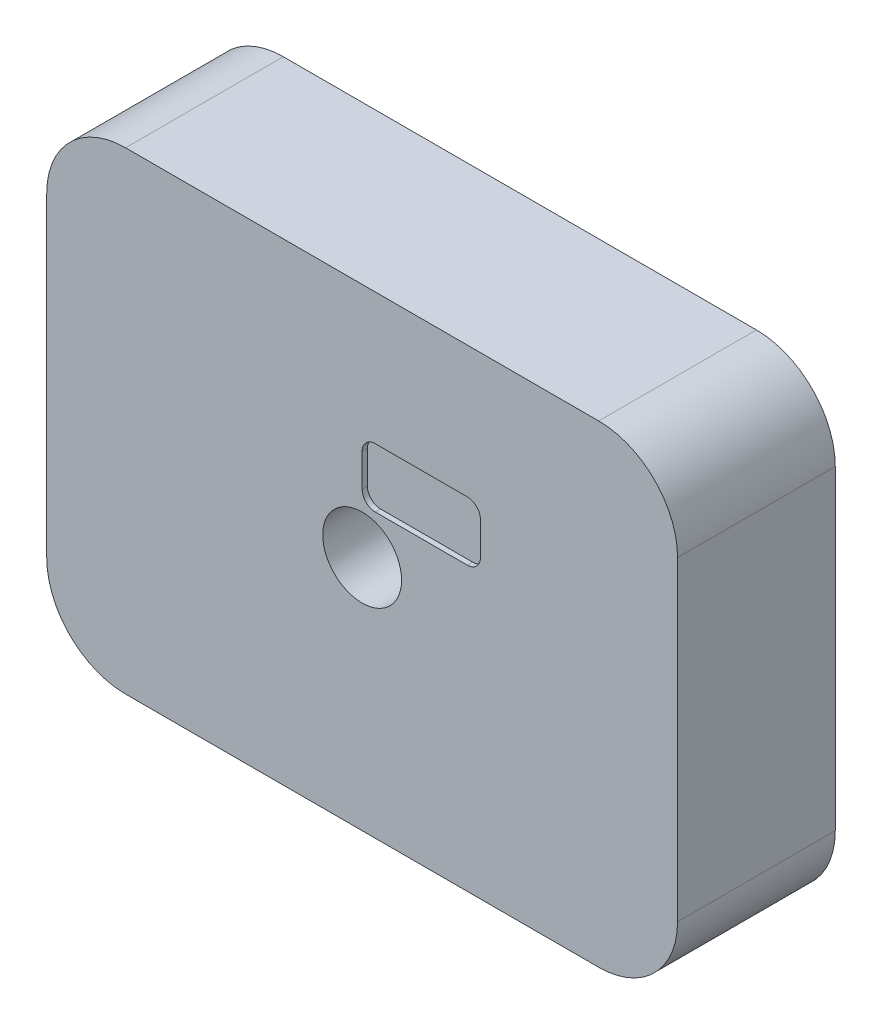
ISO-10303-21;
HEADER;
FILE_DESCRIPTION(('STEP AP214'),'2;1');
FILE_NAME('part.step','',(''),(''),'','','');
FILE_SCHEMA(('AUTOMOTIVE_DESIGN { 1 0 10303 214 1 1 1 1 }'));
ENDSEC;
DATA;
#1=APPLICATION_CONTEXT('core data for automotive mechanical design processes');
#2=APPLICATION_PROTOCOL_DEFINITION('international standard','automotive_design',2000,#1);
#3=PRODUCT_CONTEXT('',#1,'mechanical');
#4=PRODUCT('Part','Part','',(#3));
#5=PRODUCT_RELATED_PRODUCT_CATEGORY('part','',(#4));
#6=PRODUCT_DEFINITION_FORMATION('','',#4);
#7=PRODUCT_DEFINITION_CONTEXT('part definition',#1,'design');
#8=PRODUCT_DEFINITION('design','',#6,#7);
#9=PRODUCT_DEFINITION_SHAPE('','',#8);
#10=(LENGTH_UNIT() NAMED_UNIT(*) SI_UNIT(.MILLI.,.METRE.));
#11=(NAMED_UNIT(*) PLANE_ANGLE_UNIT() SI_UNIT($,.RADIAN.));
#12=(NAMED_UNIT(*) SI_UNIT($,.STERADIAN.) SOLID_ANGLE_UNIT());
#13=UNCERTAINTY_MEASURE_WITH_UNIT(LENGTH_MEASURE(1.E-05),#10,'distance_accuracy_value','');
#14=(GEOMETRIC_REPRESENTATION_CONTEXT(3) GLOBAL_UNCERTAINTY_ASSIGNED_CONTEXT((#13)) GLOBAL_UNIT_ASSIGNED_CONTEXT((#10,
#11,#12)) REPRESENTATION_CONTEXT('',''));
#15=CARTESIAN_POINT('',(0.,0.,0.));
#16=DIRECTION('',(0.,0.,1.));
#17=DIRECTION('',(1.,0.,0.));
#18=AXIS2_PLACEMENT_3D('',#15,#16,#17);
#19=CARTESIAN_POINT('',(24.,18.,12.));
#20=DIRECTION('',(-1.,0.,0.));
#21=DIRECTION('',(0.,0.,1.));
#22=AXIS2_PLACEMENT_3D('',#19,#20,#21);
#23=PLANE('',#22);
#24=DIRECTION('',(0.,1.,0.));
#25=VECTOR('',#24,1.);
#26=CARTESIAN_POINT('',(24.,18.,12.));
#27=LINE('',#26,#25);
#28=CARTESIAN_POINT('',(24.,-12.,12.));
#29=VERTEX_POINT('',#28);
#30=CARTESIAN_POINT('',(24.,12.,12.));
#31=VERTEX_POINT('',#30);
#32=EDGE_CURVE('E271',#29,#31,#27,.T.);
#33=ORIENTED_EDGE('',*,*,#32,.F.);
#34=DIRECTION('',(0.,0.,-1.));
#35=VECTOR('',#34,1.);
#36=CARTESIAN_POINT('',(24.,-12.,12.));
#37=LINE('',#36,#35);
#38=CARTESIAN_POINT('',(24.,-12.,0.));
#39=VERTEX_POINT('',#38);
#40=EDGE_CURVE('E300',#29,#39,#37,.T.);
#41=ORIENTED_EDGE('',*,*,#40,.T.);
#42=DIRECTION('',(0.,1.,0.));
#43=VECTOR('',#42,1.);
#44=CARTESIAN_POINT('',(24.,18.,0.));
#45=LINE('',#44,#43);
#46=CARTESIAN_POINT('',(24.,12.,0.));
#47=VERTEX_POINT('',#46);
#48=EDGE_CURVE('E270',#39,#47,#45,.T.);
#49=ORIENTED_EDGE('',*,*,#48,.T.);
#50=DIRECTION('',(0.,0.,-1.));
#51=VECTOR('',#50,1.);
#52=CARTESIAN_POINT('',(24.,12.,12.));
#53=LINE('',#52,#51);
#54=EDGE_CURVE('E298',#47,#31,#53,.F.);
#55=ORIENTED_EDGE('',*,*,#54,.T.);
#56=EDGE_LOOP('',(#33,#41,#49,#55));
#57=FACE_BOUND('',#56,.T.);
#58=ADVANCED_FACE('F48',(#57),#23,.F.);
#59=CARTESIAN_POINT('',(-24.,18.,12.));
#60=DIRECTION('',(0.,-1.,0.));
#61=DIRECTION('',(0.,0.,-1.));
#62=AXIS2_PLACEMENT_3D('',#59,#60,#61);
#63=PLANE('',#62);
#64=DIRECTION('',(-1.,0.,0.));
#65=VECTOR('',#64,1.);
#66=CARTESIAN_POINT('',(-24.,18.,12.));
#67=LINE('',#66,#65);
#68=CARTESIAN_POINT('',(18.,18.,12.));
#69=VERTEX_POINT('',#68);
#70=CARTESIAN_POINT('',(-18.,18.,12.));
#71=VERTEX_POINT('',#70);
#72=EDGE_CURVE('E274',#69,#71,#67,.T.);
#73=ORIENTED_EDGE('',*,*,#72,.F.);
#74=DIRECTION('',(0.,0.,-1.));
#75=VECTOR('',#74,1.);
#76=CARTESIAN_POINT('',(18.,18.,12.));
#77=LINE('',#76,#75);
#78=CARTESIAN_POINT('',(18.,18.,0.));
#79=VERTEX_POINT('',#78);
#80=EDGE_CURVE('E326',#69,#79,#77,.T.);
#81=ORIENTED_EDGE('',*,*,#80,.T.);
#82=DIRECTION('',(-1.,0.,0.));
#83=VECTOR('',#82,1.);
#84=CARTESIAN_POINT('',(-24.,18.,0.));
#85=LINE('',#84,#83);
#86=CARTESIAN_POINT('',(-18.,18.,0.));
#87=VERTEX_POINT('',#86);
#88=EDGE_CURVE('E286',#79,#87,#85,.T.);
#89=ORIENTED_EDGE('',*,*,#88,.T.);
#90=DIRECTION('',(0.,0.,-1.));
#91=VECTOR('',#90,1.);
#92=CARTESIAN_POINT('',(-18.,18.,12.));
#93=LINE('',#92,#91);
#94=EDGE_CURVE('E324',#87,#71,#93,.F.);
#95=ORIENTED_EDGE('',*,*,#94,.T.);
#96=EDGE_LOOP('',(#73,#81,#89,#95));
#97=FACE_BOUND('',#96,.T.);
#98=ADVANCED_FACE('F362',(#97),#63,.F.);
#99=CARTESIAN_POINT('',(-24.,18.,12.));
#100=DIRECTION('',(1.,0.,0.));
#101=DIRECTION('',(0.,0.,-1.));
#102=AXIS2_PLACEMENT_3D('',#99,#100,#101);
#103=PLANE('',#102);
#104=DIRECTION('',(0.,-1.,0.));
#105=VECTOR('',#104,1.);
#106=CARTESIAN_POINT('',(-24.,18.,0.));
#107=LINE('',#106,#105);
#108=CARTESIAN_POINT('',(-24.,12.,0.));
#109=VERTEX_POINT('',#108);
#110=CARTESIAN_POINT('',(-24.,-12.,0.));
#111=VERTEX_POINT('',#110);
#112=EDGE_CURVE('E289',#109,#111,#107,.T.);
#113=ORIENTED_EDGE('',*,*,#112,.T.);
#114=DIRECTION('',(0.,0.,-1.));
#115=VECTOR('',#114,1.);
#116=CARTESIAN_POINT('',(-24.,-12.,12.));
#117=LINE('',#116,#115);
#118=CARTESIAN_POINT('',(-24.,-12.,12.));
#119=VERTEX_POINT('',#118);
#120=EDGE_CURVE('E13',#111,#119,#117,.F.);
#121=ORIENTED_EDGE('',*,*,#120,.T.);
#122=DIRECTION('',(0.,-1.,0.));
#123=VECTOR('',#122,1.);
#124=CARTESIAN_POINT('',(-24.,18.,12.));
#125=LINE('',#124,#123);
#126=CARTESIAN_POINT('',(-24.,12.,12.));
#127=VERTEX_POINT('',#126);
#128=EDGE_CURVE('E278',#127,#119,#125,.T.);
#129=ORIENTED_EDGE('',*,*,#128,.F.);
#130=DIRECTION('',(0.,0.,-1.));
#131=VECTOR('',#130,1.);
#132=CARTESIAN_POINT('',(-24.,12.,12.));
#133=LINE('',#132,#131);
#134=EDGE_CURVE('E56',#127,#109,#133,.T.);
#135=ORIENTED_EDGE('',*,*,#134,.T.);
#136=EDGE_LOOP('',(#113,#121,#129,#135));
#137=FACE_BOUND('',#136,.T.);
#138=ADVANCED_FACE('F331',(#137),#103,.F.);
#139=CARTESIAN_POINT('',(-24.,-18.,12.));
#140=DIRECTION('',(0.,1.,0.));
#141=DIRECTION('',(-1.,0.,0.));
#142=AXIS2_PLACEMENT_3D('',#139,#140,#141);
#143=PLANE('',#142);
#144=DIRECTION('',(1.,0.,0.));
#145=VECTOR('',#144,1.);
#146=CARTESIAN_POINT('',(-24.,-18.,0.));
#147=LINE('',#146,#145);
#148=CARTESIAN_POINT('',(-18.,-18.,0.));
#149=VERTEX_POINT('',#148);
#150=CARTESIAN_POINT('',(18.,-18.,0.));
#151=VERTEX_POINT('',#150);
#152=EDGE_CURVE('E275',#149,#151,#147,.T.);
#153=ORIENTED_EDGE('',*,*,#152,.T.);
#154=DIRECTION('',(0.,0.,-1.));
#155=VECTOR('',#154,1.);
#156=CARTESIAN_POINT('',(18.,-18.,12.));
#157=LINE('',#156,#155);
#158=CARTESIAN_POINT('',(18.,-18.,12.));
#159=VERTEX_POINT('',#158);
#160=EDGE_CURVE('E314',#151,#159,#157,.F.);
#161=ORIENTED_EDGE('',*,*,#160,.T.);
#162=DIRECTION('',(1.,0.,0.));
#163=VECTOR('',#162,1.);
#164=CARTESIAN_POINT('',(-24.,-18.,12.));
#165=LINE('',#164,#163);
#166=CARTESIAN_POINT('',(-18.,-18.,12.));
#167=VERTEX_POINT('',#166);
#168=EDGE_CURVE('E280',#167,#159,#165,.T.);
#169=ORIENTED_EDGE('',*,*,#168,.F.);
#170=DIRECTION('',(0.,0.,-1.));
#171=VECTOR('',#170,1.);
#172=CARTESIAN_POINT('',(-18.,-18.,12.));
#173=LINE('',#172,#171);
#174=EDGE_CURVE('E311',#167,#149,#173,.T.);
#175=ORIENTED_EDGE('',*,*,#174,.T.);
#176=EDGE_LOOP('',(#153,#161,#169,#175));
#177=FACE_BOUND('',#176,.T.);
#178=ADVANCED_FACE('F345',(#177),#143,.F.);
#179=CARTESIAN_POINT('',(24.,18.,12.));
#180=DIRECTION('',(0.,0.,1.));
#181=DIRECTION('',(1.,0.,0.));
#182=AXIS2_PLACEMENT_3D('',#179,#180,#181);
#183=PLANE('',#182);
#184=CARTESIAN_POINT('',(8.,4.5,12.));
#185=DIRECTION('',(0.,0.,1.));
#186=DIRECTION('',(1.,0.,0.));
#187=AXIS2_PLACEMENT_3D('',#184,#185,#186);
#188=CIRCLE('',#187,0.999999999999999);
#189=CARTESIAN_POINT('',(7.99999999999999,3.5,12.));
#190=VERTEX_POINT('',#189);
#191=CARTESIAN_POINT('',(9.,4.50000000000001,12.));
#192=VERTEX_POINT('',#191);
#193=EDGE_CURVE('E63',#190,#192,#188,.T.);
#194=ORIENTED_EDGE('',*,*,#193,.F.);
#195=DIRECTION('',(1.,0.,0.));
#196=VECTOR('',#195,1.);
#197=CARTESIAN_POINT('',(1.00000000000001,3.5,12.));
#198=LINE('',#197,#196);
#199=CARTESIAN_POINT('',(1.00000000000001,3.5,12.));
#200=VERTEX_POINT('',#199);
#201=EDGE_CURVE('E194',#200,#190,#198,.T.);
#202=ORIENTED_EDGE('',*,*,#201,.F.);
#203=CARTESIAN_POINT('',(1.,4.5,12.));
#204=DIRECTION('',(0.,0.,1.));
#205=DIRECTION('',(1.,0.,0.));
#206=AXIS2_PLACEMENT_3D('',#203,#204,#205);
#207=CIRCLE('',#206,1.);
#208=CARTESIAN_POINT('',(0.,4.50000000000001,12.));
#209=VERTEX_POINT('',#208);
#210=EDGE_CURVE('E197',#209,#200,#207,.T.);
#211=ORIENTED_EDGE('',*,*,#210,.F.);
#212=DIRECTION('',(0.,-1.,0.));
#213=VECTOR('',#212,1.);
#214=CARTESIAN_POINT('',(0.,6.99999999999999,12.));
#215=LINE('',#214,#213);
#216=CARTESIAN_POINT('',(0.,6.99999999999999,12.));
#217=VERTEX_POINT('',#216);
#218=EDGE_CURVE('E225',#217,#209,#215,.T.);
#219=ORIENTED_EDGE('',*,*,#218,.F.);
#220=CARTESIAN_POINT('',(0.999999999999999,7.,12.));
#221=DIRECTION('',(0.,0.,1.));
#222=DIRECTION('',(1.,0.,0.));
#223=AXIS2_PLACEMENT_3D('',#220,#221,#222);
#224=CIRCLE('',#223,1.);
#225=CARTESIAN_POINT('',(1.00000000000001,8.,12.));
#226=VERTEX_POINT('',#225);
#227=EDGE_CURVE('E222',#226,#217,#224,.T.);
#228=ORIENTED_EDGE('',*,*,#227,.F.);
#229=DIRECTION('',(-1.,0.,0.));
#230=VECTOR('',#229,1.);
#231=CARTESIAN_POINT('',(1.00000000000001,8.,12.));
#232=LINE('',#231,#230);
#233=CARTESIAN_POINT('',(7.99999999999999,8.,12.));
#234=VERTEX_POINT('',#233);
#235=EDGE_CURVE('E219',#234,#226,#232,.T.);
#236=ORIENTED_EDGE('',*,*,#235,.F.);
#237=CARTESIAN_POINT('',(8.,7.,12.));
#238=DIRECTION('',(0.,0.,1.));
#239=DIRECTION('',(-1.,0.,0.));
#240=AXIS2_PLACEMENT_3D('',#237,#238,#239);
#241=CIRCLE('',#240,1.);
#242=CARTESIAN_POINT('',(9.,6.99999999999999,12.));
#243=VERTEX_POINT('',#242);
#244=EDGE_CURVE('E216',#243,#234,#241,.T.);
#245=ORIENTED_EDGE('',*,*,#244,.F.);
#246=DIRECTION('',(0.,1.,0.));
#247=VECTOR('',#246,1.);
#248=CARTESIAN_POINT('',(9.,6.99999999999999,12.));
#249=LINE('',#248,#247);
#250=EDGE_CURVE('E214',#192,#243,#249,.T.);
#251=ORIENTED_EDGE('',*,*,#250,.F.);
#252=EDGE_LOOP('',(#194,#202,#211,#219,#228,#236,#245,#251));
#253=FACE_BOUND('',#252,.T.);
#254=CARTESIAN_POINT('',(0.,0.,12.));
#255=DIRECTION('',(0.,0.,1.));
#256=DIRECTION('',(1.,0.,0.));
#257=AXIS2_PLACEMENT_3D('',#254,#255,#256);
#258=CIRCLE('',#257,3.);
#259=CARTESIAN_POINT('',(3.,0.,12.));
#260=VERTEX_POINT('',#259);
#261=EDGE_CURVE('E267',#260,#260,#258,.T.);
#262=ORIENTED_EDGE('',*,*,#261,.F.);
#263=EDGE_LOOP('',(#262));
#264=FACE_BOUND('',#263,.T.);
#265=ORIENTED_EDGE('',*,*,#168,.T.);
#266=CARTESIAN_POINT('',(18.,-12.,12.));
#267=DIRECTION('',(0.,0.,1.));
#268=DIRECTION('',(1.,0.,0.));
#269=AXIS2_PLACEMENT_3D('',#266,#267,#268);
#270=CIRCLE('',#269,6.);
#271=EDGE_CURVE('E322',#159,#29,#270,.T.);
#272=ORIENTED_EDGE('',*,*,#271,.T.);
#273=ORIENTED_EDGE('',*,*,#32,.T.);
#274=CARTESIAN_POINT('',(18.,12.,12.));
#275=DIRECTION('',(0.,0.,1.));
#276=DIRECTION('',(1.,0.,0.));
#277=AXIS2_PLACEMENT_3D('',#274,#275,#276);
#278=CIRCLE('',#277,6.);
#279=EDGE_CURVE('E320',#31,#69,#278,.T.);
#280=ORIENTED_EDGE('',*,*,#279,.T.);
#281=ORIENTED_EDGE('',*,*,#72,.T.);
#282=CARTESIAN_POINT('',(-18.,12.,12.));
#283=DIRECTION('',(0.,0.,1.));
#284=DIRECTION('',(1.,0.,0.));
#285=AXIS2_PLACEMENT_3D('',#282,#283,#284);
#286=CIRCLE('',#285,6.);
#287=EDGE_CURVE('E316',#71,#127,#286,.T.);
#288=ORIENTED_EDGE('',*,*,#287,.T.);
#289=ORIENTED_EDGE('',*,*,#128,.T.);
#290=CARTESIAN_POINT('',(-18.,-12.,12.));
#291=DIRECTION('',(0.,0.,1.));
#292=DIRECTION('',(1.,0.,0.));
#293=AXIS2_PLACEMENT_3D('',#290,#291,#292);
#294=CIRCLE('',#293,6.);
#295=EDGE_CURVE('E318',#119,#167,#294,.T.);
#296=ORIENTED_EDGE('',*,*,#295,.T.);
#297=EDGE_LOOP('',(#265,#272,#273,#280,#281,#288,#289,#296));
#298=FACE_BOUND('',#297,.T.);
#299=ADVANCED_FACE('F349',(#253,#264,#298),#183,.T.);
#300=CARTESIAN_POINT('',(24.,18.,0.));
#301=DIRECTION('',(0.,0.,1.));
#302=DIRECTION('',(1.,0.,0.));
#303=AXIS2_PLACEMENT_3D('',#300,#301,#302);
#304=PLANE('',#303);
#305=CARTESIAN_POINT('',(-18.,12.,0.));
#306=DIRECTION('',(0.,0.,-1.));
#307=DIRECTION('',(-1.,0.,0.));
#308=AXIS2_PLACEMENT_3D('',#305,#306,#307);
#309=CIRCLE('',#308,1.64999999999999);
#310=CARTESIAN_POINT('',(-19.65,12.,0.));
#311=VERTEX_POINT('',#310);
#312=EDGE_CURVE('E232',#311,#311,#309,.T.);
#313=ORIENTED_EDGE('',*,*,#312,.F.);
#314=EDGE_LOOP('',(#313));
#315=FACE_BOUND('',#314,.T.);
#316=CARTESIAN_POINT('',(18.,12.,0.));
#317=DIRECTION('',(0.,0.,-1.));
#318=DIRECTION('',(-1.,0.,0.));
#319=AXIS2_PLACEMENT_3D('',#316,#317,#318);
#320=CIRCLE('',#319,1.64999999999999);
#321=CARTESIAN_POINT('',(16.35,12.,0.));
#322=VERTEX_POINT('',#321);
#323=EDGE_CURVE('E249',#322,#322,#320,.T.);
#324=ORIENTED_EDGE('',*,*,#323,.F.);
#325=EDGE_LOOP('',(#324));
#326=FACE_BOUND('',#325,.T.);
#327=CARTESIAN_POINT('',(18.,-12.,0.));
#328=DIRECTION('',(0.,0.,-1.));
#329=DIRECTION('',(-1.,0.,0.));
#330=AXIS2_PLACEMENT_3D('',#327,#328,#329);
#331=CIRCLE('',#330,1.64999999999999);
#332=CARTESIAN_POINT('',(16.35,-12.,0.));
#333=VERTEX_POINT('',#332);
#334=EDGE_CURVE('E255',#333,#333,#331,.T.);
#335=ORIENTED_EDGE('',*,*,#334,.F.);
#336=EDGE_LOOP('',(#335));
#337=FACE_BOUND('',#336,.T.);
#338=CARTESIAN_POINT('',(-18.,-12.,0.));
#339=DIRECTION('',(0.,0.,-1.));
#340=DIRECTION('',(-1.,0.,0.));
#341=AXIS2_PLACEMENT_3D('',#338,#339,#340);
#342=CIRCLE('',#341,1.64999999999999);
#343=CARTESIAN_POINT('',(-19.65,-12.,0.));
#344=VERTEX_POINT('',#343);
#345=EDGE_CURVE('E261',#344,#344,#342,.T.);
#346=ORIENTED_EDGE('',*,*,#345,.F.);
#347=EDGE_LOOP('',(#346));
#348=FACE_BOUND('',#347,.T.);
#349=CARTESIAN_POINT('',(0.,0.,0.));
#350=DIRECTION('',(0.,0.,1.));
#351=DIRECTION('',(1.,0.,0.));
#352=AXIS2_PLACEMENT_3D('',#349,#350,#351);
#353=CIRCLE('',#352,3.5);
#354=CARTESIAN_POINT('',(3.5,0.,0.));
#355=VERTEX_POINT('',#354);
#356=EDGE_CURVE('E283',#355,#355,#353,.T.);
#357=ORIENTED_EDGE('',*,*,#356,.T.);
#358=EDGE_LOOP('',(#357));
#359=FACE_BOUND('',#358,.T.);
#360=ORIENTED_EDGE('',*,*,#48,.F.);
#361=CARTESIAN_POINT('',(18.,-12.,0.));
#362=DIRECTION('',(0.,0.,1.));
#363=DIRECTION('',(1.,0.,0.));
#364=AXIS2_PLACEMENT_3D('',#361,#362,#363);
#365=CIRCLE('',#364,6.);
#366=EDGE_CURVE('E309',#39,#151,#365,.F.);
#367=ORIENTED_EDGE('',*,*,#366,.T.);
#368=ORIENTED_EDGE('',*,*,#152,.F.);
#369=CARTESIAN_POINT('',(-18.,-12.,0.));
#370=DIRECTION('',(0.,0.,1.));
#371=DIRECTION('',(1.,0.,0.));
#372=AXIS2_PLACEMENT_3D('',#369,#370,#371);
#373=CIRCLE('',#372,6.);
#374=EDGE_CURVE('E305',#149,#111,#373,.F.);
#375=ORIENTED_EDGE('',*,*,#374,.T.);
#376=ORIENTED_EDGE('',*,*,#112,.F.);
#377=CARTESIAN_POINT('',(-18.,12.,0.));
#378=DIRECTION('',(0.,0.,1.));
#379=DIRECTION('',(1.,0.,0.));
#380=AXIS2_PLACEMENT_3D('',#377,#378,#379);
#381=CIRCLE('',#380,6.);
#382=EDGE_CURVE('E303',#109,#87,#381,.F.);
#383=ORIENTED_EDGE('',*,*,#382,.T.);
#384=ORIENTED_EDGE('',*,*,#88,.F.);
#385=CARTESIAN_POINT('',(18.,12.,0.));
#386=DIRECTION('',(0.,0.,1.));
#387=DIRECTION('',(1.,0.,0.));
#388=AXIS2_PLACEMENT_3D('',#385,#386,#387);
#389=CIRCLE('',#388,6.);
#390=EDGE_CURVE('E307',#79,#47,#389,.F.);
#391=ORIENTED_EDGE('',*,*,#390,.T.);
#392=EDGE_LOOP('',(#360,#367,#368,#375,#376,#383,#384,#391));
#393=FACE_BOUND('',#392,.T.);
#394=ADVANCED_FACE('F336',(#315,#326,#337,#348,#359,#393),#304,.F.);
#395=CARTESIAN_POINT('',(0.,0.,0.));
#396=DIRECTION('',(0.,0.,1.));
#397=DIRECTION('',(1.,0.,0.));
#398=AXIS2_PLACEMENT_3D('',#395,#396,#397);
#399=CYLINDRICAL_SURFACE('',#398,3.);
#400=CARTESIAN_POINT('',(0.,0.,0.500000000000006));
#401=DIRECTION('',(0.,0.,1.));
#402=DIRECTION('',(1.,0.,0.));
#403=AXIS2_PLACEMENT_3D('',#400,#401,#402);
#404=CIRCLE('',#403,3.);
#405=CARTESIAN_POINT('',(3.,0.,0.500000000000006));
#406=VERTEX_POINT('',#405);
#407=EDGE_CURVE('E295',#406,#406,#404,.F.);
#408=ORIENTED_EDGE('',*,*,#407,.T.);
#409=EDGE_LOOP('',(#408));
#410=FACE_BOUND('',#409,.T.);
#411=ORIENTED_EDGE('',*,*,#261,.T.);
#412=EDGE_LOOP('',(#411));
#413=FACE_BOUND('',#412,.T.);
#414=ADVANCED_FACE('F383',(#410,#413),#399,.F.);
#415=CARTESIAN_POINT('',(0.,0.,0.));
#416=DIRECTION('',(0.,0.,-1.));
#417=DIRECTION('',(-1.,0.,0.));
#418=AXIS2_PLACEMENT_3D('',#415,#416,#417);
#419=CONICAL_SURFACE('',#418,3.5,0.785398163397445);
#420=ORIENTED_EDGE('',*,*,#407,.F.);
#421=EDGE_LOOP('',(#420));
#422=FACE_BOUND('',#421,.T.);
#423=ORIENTED_EDGE('',*,*,#356,.F.);
#424=EDGE_LOOP('',(#423));
#425=FACE_BOUND('',#424,.T.);
#426=ADVANCED_FACE('F379',(#422,#425),#419,.F.);
#427=CARTESIAN_POINT('',(-18.,-12.,10.1));
#428=DIRECTION('',(0.,0.,-1.));
#429=DIRECTION('',(-1.,0.,0.));
#430=AXIS2_PLACEMENT_3D('',#427,#428,#429);
#431=CONICAL_SURFACE('',#430,1.64999999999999,1.02974425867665);
#432=CARTESIAN_POINT('',(-18.,-12.,11.0914200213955));
#433=VERTEX_POINT('',#432);
#434=VERTEX_LOOP('',#433);
#435=FACE_BOUND('',#434,.T.);
#436=CARTESIAN_POINT('',(-18.,-12.,10.1));
#437=DIRECTION('',(0.,0.,-1.));
#438=DIRECTION('',(-1.,0.,0.));
#439=AXIS2_PLACEMENT_3D('',#436,#437,#438);
#440=CIRCLE('',#439,1.64999999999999);
#441=CARTESIAN_POINT('',(-19.65,-12.,10.1));
#442=VERTEX_POINT('',#441);
#443=EDGE_CURVE('E264',#442,#442,#440,.T.);
#444=ORIENTED_EDGE('',*,*,#443,.T.);
#445=EDGE_LOOP('',(#444));
#446=FACE_BOUND('',#445,.T.);
#447=ADVANCED_FACE('F382',(#435,#446),#431,.F.);
#448=CARTESIAN_POINT('',(-18.,-12.,0.));
#449=DIRECTION('',(0.,0.,-1.));
#450=DIRECTION('',(-1.,0.,0.));
#451=AXIS2_PLACEMENT_3D('',#448,#449,#450);
#452=CYLINDRICAL_SURFACE('',#451,1.64999999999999);
#453=ORIENTED_EDGE('',*,*,#443,.F.);
#454=EDGE_LOOP('',(#453));
#455=FACE_BOUND('',#454,.T.);
#456=ORIENTED_EDGE('',*,*,#345,.T.);
#457=EDGE_LOOP('',(#456));
#458=FACE_BOUND('',#457,.T.);
#459=ADVANCED_FACE('F522',(#455,#458),#452,.F.);
#460=CARTESIAN_POINT('',(18.,-12.,10.1));
#461=DIRECTION('',(0.,0.,-1.));
#462=DIRECTION('',(-1.,0.,0.));
#463=AXIS2_PLACEMENT_3D('',#460,#461,#462);
#464=CONICAL_SURFACE('',#463,1.64999999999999,1.02974425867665);
#465=CARTESIAN_POINT('',(18.,-12.,11.0914200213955));
#466=VERTEX_POINT('',#465);
#467=VERTEX_LOOP('',#466);
#468=FACE_BOUND('',#467,.T.);
#469=CARTESIAN_POINT('',(18.,-12.,10.1));
#470=DIRECTION('',(0.,0.,-1.));
#471=DIRECTION('',(-1.,0.,0.));
#472=AXIS2_PLACEMENT_3D('',#469,#470,#471);
#473=CIRCLE('',#472,1.64999999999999);
#474=CARTESIAN_POINT('',(16.35,-12.,10.1));
#475=VERTEX_POINT('',#474);
#476=EDGE_CURVE('E258',#475,#475,#473,.T.);
#477=ORIENTED_EDGE('',*,*,#476,.T.);
#478=EDGE_LOOP('',(#477));
#479=FACE_BOUND('',#478,.T.);
#480=ADVANCED_FACE('F518',(#468,#479),#464,.F.);
#481=CARTESIAN_POINT('',(18.,-12.,0.));
#482=DIRECTION('',(0.,0.,-1.));
#483=DIRECTION('',(-1.,0.,0.));
#484=AXIS2_PLACEMENT_3D('',#481,#482,#483);
#485=CYLINDRICAL_SURFACE('',#484,1.64999999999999);
#486=ORIENTED_EDGE('',*,*,#476,.F.);
#487=EDGE_LOOP('',(#486));
#488=FACE_BOUND('',#487,.T.);
#489=ORIENTED_EDGE('',*,*,#334,.T.);
#490=EDGE_LOOP('',(#489));
#491=FACE_BOUND('',#490,.T.);
#492=ADVANCED_FACE('F514',(#488,#491),#485,.F.);
#493=CARTESIAN_POINT('',(18.,12.,10.1));
#494=DIRECTION('',(0.,0.,-1.));
#495=DIRECTION('',(-1.,0.,0.));
#496=AXIS2_PLACEMENT_3D('',#493,#494,#495);
#497=CONICAL_SURFACE('',#496,1.64999999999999,1.02974425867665);
#498=CARTESIAN_POINT('',(18.,12.,11.0914200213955));
#499=VERTEX_POINT('',#498);
#500=VERTEX_LOOP('',#499);
#501=FACE_BOUND('',#500,.T.);
#502=CARTESIAN_POINT('',(18.,12.,10.1));
#503=DIRECTION('',(0.,0.,-1.));
#504=DIRECTION('',(-1.,0.,0.));
#505=AXIS2_PLACEMENT_3D('',#502,#503,#504);
#506=CIRCLE('',#505,1.64999999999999);
#507=CARTESIAN_POINT('',(16.35,12.,10.1));
#508=VERTEX_POINT('',#507);
#509=EDGE_CURVE('E252',#508,#508,#506,.T.);
#510=ORIENTED_EDGE('',*,*,#509,.T.);
#511=EDGE_LOOP('',(#510));
#512=FACE_BOUND('',#511,.T.);
#513=ADVANCED_FACE('F510',(#501,#512),#497,.F.);
#514=CARTESIAN_POINT('',(18.,12.,0.));
#515=DIRECTION('',(0.,0.,-1.));
#516=DIRECTION('',(-1.,0.,0.));
#517=AXIS2_PLACEMENT_3D('',#514,#515,#516);
#518=CYLINDRICAL_SURFACE('',#517,1.64999999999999);
#519=ORIENTED_EDGE('',*,*,#509,.F.);
#520=EDGE_LOOP('',(#519));
#521=FACE_BOUND('',#520,.T.);
#522=ORIENTED_EDGE('',*,*,#323,.T.);
#523=EDGE_LOOP('',(#522));
#524=FACE_BOUND('',#523,.T.);
#525=ADVANCED_FACE('F506',(#521,#524),#518,.F.);
#526=CARTESIAN_POINT('',(-18.,12.,10.1));
#527=DIRECTION('',(0.,0.,-1.));
#528=DIRECTION('',(-1.,0.,0.));
#529=AXIS2_PLACEMENT_3D('',#526,#527,#528);
#530=CONICAL_SURFACE('',#529,1.64999999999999,1.02974425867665);
#531=CARTESIAN_POINT('',(-18.,12.,11.0914200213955));
#532=VERTEX_POINT('',#531);
#533=VERTEX_LOOP('',#532);
#534=FACE_BOUND('',#533,.T.);
#535=CARTESIAN_POINT('',(-18.,12.,10.1));
#536=DIRECTION('',(0.,0.,-1.));
#537=DIRECTION('',(-1.,0.,0.));
#538=AXIS2_PLACEMENT_3D('',#535,#536,#537);
#539=CIRCLE('',#538,1.64999999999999);
#540=CARTESIAN_POINT('',(-19.65,12.,10.1));
#541=VERTEX_POINT('',#540);
#542=EDGE_CURVE('E246',#541,#541,#539,.T.);
#543=ORIENTED_EDGE('',*,*,#542,.T.);
#544=EDGE_LOOP('',(#543));
#545=FACE_BOUND('',#544,.T.);
#546=ADVANCED_FACE('F502',(#534,#545),#530,.F.);
#547=CARTESIAN_POINT('',(-18.,12.,0.));
#548=DIRECTION('',(0.,0.,-1.));
#549=DIRECTION('',(-1.,0.,0.));
#550=AXIS2_PLACEMENT_3D('',#547,#548,#549);
#551=CYLINDRICAL_SURFACE('',#550,1.64999999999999);
#552=ORIENTED_EDGE('',*,*,#542,.F.);
#553=EDGE_LOOP('',(#552));
#554=FACE_BOUND('',#553,.T.);
#555=ORIENTED_EDGE('',*,*,#312,.T.);
#556=EDGE_LOOP('',(#555));
#557=FACE_BOUND('',#556,.T.);
#558=ADVANCED_FACE('F387',(#554,#557),#551,.F.);
#559=CARTESIAN_POINT('',(18.,-12.,12.));
#560=DIRECTION('',(0.,0.,-1.));
#561=DIRECTION('',(-1.,0.,0.));
#562=AXIS2_PLACEMENT_3D('',#559,#560,#561);
#563=CYLINDRICAL_SURFACE('',#562,6.);
#564=ORIENTED_EDGE('',*,*,#271,.F.);
#565=ORIENTED_EDGE('',*,*,#160,.F.);
#566=ORIENTED_EDGE('',*,*,#366,.F.);
#567=ORIENTED_EDGE('',*,*,#40,.F.);
#568=EDGE_LOOP('',(#564,#565,#566,#567));
#569=FACE_BOUND('',#568,.T.);
#570=ADVANCED_FACE('F353',(#569),#563,.T.);
#571=CARTESIAN_POINT('',(18.,12.,12.));
#572=DIRECTION('',(0.,0.,-1.));
#573=DIRECTION('',(-1.,0.,0.));
#574=AXIS2_PLACEMENT_3D('',#571,#572,#573);
#575=CYLINDRICAL_SURFACE('',#574,6.);
#576=ORIENTED_EDGE('',*,*,#279,.F.);
#577=ORIENTED_EDGE('',*,*,#54,.F.);
#578=ORIENTED_EDGE('',*,*,#390,.F.);
#579=ORIENTED_EDGE('',*,*,#80,.F.);
#580=EDGE_LOOP('',(#576,#577,#578,#579));
#581=FACE_BOUND('',#580,.T.);
#582=ADVANCED_FACE('F359',(#581),#575,.T.);
#583=CARTESIAN_POINT('',(-18.,-12.,12.));
#584=DIRECTION('',(0.,0.,-1.));
#585=DIRECTION('',(-1.,0.,0.));
#586=AXIS2_PLACEMENT_3D('',#583,#584,#585);
#587=CYLINDRICAL_SURFACE('',#586,6.);
#588=ORIENTED_EDGE('',*,*,#295,.F.);
#589=ORIENTED_EDGE('',*,*,#120,.F.);
#590=ORIENTED_EDGE('',*,*,#374,.F.);
#591=ORIENTED_EDGE('',*,*,#174,.F.);
#592=EDGE_LOOP('',(#588,#589,#590,#591));
#593=FACE_BOUND('',#592,.T.);
#594=ADVANCED_FACE('F342',(#593),#587,.T.);
#595=CARTESIAN_POINT('',(-18.,12.,12.));
#596=DIRECTION('',(0.,0.,-1.));
#597=DIRECTION('',(-1.,0.,0.));
#598=AXIS2_PLACEMENT_3D('',#595,#596,#597);
#599=CYLINDRICAL_SURFACE('',#598,6.);
#600=ORIENTED_EDGE('',*,*,#287,.F.);
#601=ORIENTED_EDGE('',*,*,#94,.F.);
#602=ORIENTED_EDGE('',*,*,#382,.F.);
#603=ORIENTED_EDGE('',*,*,#134,.F.);
#604=EDGE_LOOP('',(#600,#601,#602,#603));
#605=FACE_BOUND('',#604,.T.);
#606=ADVANCED_FACE('F50',(#605),#599,.T.);
#607=CARTESIAN_POINT('',(8.,4.5,11.6));
#608=DIRECTION('',(0.,0.,1.));
#609=DIRECTION('',(1.,0.,0.));
#610=AXIS2_PLACEMENT_3D('',#607,#608,#609);
#611=CYLINDRICAL_SURFACE('',#610,0.999999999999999);
#612=ORIENTED_EDGE('',*,*,#193,.T.);
#613=DIRECTION('',(0.,0.,1.));
#614=VECTOR('',#613,1.);
#615=CARTESIAN_POINT('',(9.,4.50000000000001,11.6));
#616=LINE('',#615,#614);
#617=CARTESIAN_POINT('',(9.,4.50000000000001,11.6));
#618=VERTEX_POINT('',#617);
#619=EDGE_CURVE('E171',#618,#192,#616,.T.);
#620=ORIENTED_EDGE('',*,*,#619,.F.);
#621=CARTESIAN_POINT('',(8.,4.5,11.6));
#622=DIRECTION('',(0.,0.,1.));
#623=DIRECTION('',(1.,0.,0.));
#624=AXIS2_PLACEMENT_3D('',#621,#622,#623);
#625=CIRCLE('',#624,0.999999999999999);
#626=CARTESIAN_POINT('',(7.99999999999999,3.5,11.6));
#627=VERTEX_POINT('',#626);
#628=EDGE_CURVE('E175',#627,#618,#625,.T.);
#629=ORIENTED_EDGE('',*,*,#628,.F.);
#630=DIRECTION('',(0.,0.,1.));
#631=VECTOR('',#630,1.);
#632=CARTESIAN_POINT('',(7.99999999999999,3.5,11.6));
#633=LINE('',#632,#631);
#634=EDGE_CURVE('E230',#627,#190,#633,.T.);
#635=ORIENTED_EDGE('',*,*,#634,.T.);
#636=EDGE_LOOP('',(#612,#620,#629,#635));
#637=FACE_BOUND('',#636,.T.);
#638=ADVANCED_FACE('F173',(#637),#611,.F.);
#639=CARTESIAN_POINT('',(1.00000000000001,3.5,11.6));
#640=DIRECTION('',(0.,-1.,0.));
#641=DIRECTION('',(0.,0.,-1.));
#642=AXIS2_PLACEMENT_3D('',#639,#640,#641);
#643=PLANE('',#642);
#644=ORIENTED_EDGE('',*,*,#201,.T.);
#645=ORIENTED_EDGE('',*,*,#634,.F.);
#646=DIRECTION('',(1.,0.,0.));
#647=VECTOR('',#646,1.);
#648=CARTESIAN_POINT('',(1.00000000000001,3.5,11.6));
#649=LINE('',#648,#647);
#650=CARTESIAN_POINT('',(1.00000000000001,3.5,11.6));
#651=VERTEX_POINT('',#650);
#652=EDGE_CURVE('E181',#651,#627,#649,.T.);
#653=ORIENTED_EDGE('',*,*,#652,.F.);
#654=DIRECTION('',(0.,0.,1.));
#655=VECTOR('',#654,1.);
#656=CARTESIAN_POINT('',(1.00000000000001,3.5,11.6));
#657=LINE('',#656,#655);
#658=EDGE_CURVE('E233',#651,#200,#657,.T.);
#659=ORIENTED_EDGE('',*,*,#658,.T.);
#660=EDGE_LOOP('',(#644,#645,#653,#659));
#661=FACE_BOUND('',#660,.T.);
#662=ADVANCED_FACE('F369',(#661),#643,.F.);
#663=CARTESIAN_POINT('',(1.,4.5,11.6));
#664=DIRECTION('',(0.,0.,1.));
#665=DIRECTION('',(1.,0.,0.));
#666=AXIS2_PLACEMENT_3D('',#663,#664,#665);
#667=CYLINDRICAL_SURFACE('',#666,1.);
#668=ORIENTED_EDGE('',*,*,#210,.T.);
#669=ORIENTED_EDGE('',*,*,#658,.F.);
#670=CARTESIAN_POINT('',(1.,4.5,11.6));
#671=DIRECTION('',(0.,0.,1.));
#672=DIRECTION('',(1.,0.,0.));
#673=AXIS2_PLACEMENT_3D('',#670,#671,#672);
#674=CIRCLE('',#673,1.);
#675=CARTESIAN_POINT('',(0.,4.50000000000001,11.6));
#676=VERTEX_POINT('',#675);
#677=EDGE_CURVE('E210',#676,#651,#674,.T.);
#678=ORIENTED_EDGE('',*,*,#677,.F.);
#679=DIRECTION('',(0.,0.,1.));
#680=VECTOR('',#679,1.);
#681=CARTESIAN_POINT('',(0.,4.50000000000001,11.6));
#682=LINE('',#681,#680);
#683=EDGE_CURVE('E235',#676,#209,#682,.T.);
#684=ORIENTED_EDGE('',*,*,#683,.T.);
#685=EDGE_LOOP('',(#668,#669,#678,#684));
#686=FACE_BOUND('',#685,.T.);
#687=ADVANCED_FACE('F430',(#686),#667,.F.);
#688=CARTESIAN_POINT('',(0.,6.99999999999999,11.6));
#689=DIRECTION('',(-1.,0.,0.));
#690=DIRECTION('',(0.,-1.,0.));
#691=AXIS2_PLACEMENT_3D('',#688,#689,#690);
#692=PLANE('',#691);
#693=ORIENTED_EDGE('',*,*,#218,.T.);
#694=ORIENTED_EDGE('',*,*,#683,.F.);
#695=DIRECTION('',(0.,-1.,0.));
#696=VECTOR('',#695,1.);
#697=CARTESIAN_POINT('',(0.,6.99999999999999,11.6));
#698=LINE('',#697,#696);
#699=CARTESIAN_POINT('',(0.,6.99999999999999,11.6));
#700=VERTEX_POINT('',#699);
#701=EDGE_CURVE('E207',#700,#676,#698,.T.);
#702=ORIENTED_EDGE('',*,*,#701,.F.);
#703=DIRECTION('',(0.,0.,1.));
#704=VECTOR('',#703,1.);
#705=CARTESIAN_POINT('',(0.,6.99999999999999,11.6));
#706=LINE('',#705,#704);
#707=EDGE_CURVE('E237',#700,#217,#706,.T.);
#708=ORIENTED_EDGE('',*,*,#707,.T.);
#709=EDGE_LOOP('',(#693,#694,#702,#708));
#710=FACE_BOUND('',#709,.T.);
#711=ADVANCED_FACE('F440',(#710),#692,.F.);
#712=CARTESIAN_POINT('',(0.999999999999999,7.,11.6));
#713=DIRECTION('',(0.,0.,1.));
#714=DIRECTION('',(1.,0.,0.));
#715=AXIS2_PLACEMENT_3D('',#712,#713,#714);
#716=CYLINDRICAL_SURFACE('',#715,1.);
#717=ORIENTED_EDGE('',*,*,#227,.T.);
#718=ORIENTED_EDGE('',*,*,#707,.F.);
#719=CARTESIAN_POINT('',(0.999999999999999,7.,11.6));
#720=DIRECTION('',(0.,0.,1.));
#721=DIRECTION('',(1.,0.,0.));
#722=AXIS2_PLACEMENT_3D('',#719,#720,#721);
#723=CIRCLE('',#722,1.);
#724=CARTESIAN_POINT('',(1.00000000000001,8.,11.6));
#725=VERTEX_POINT('',#724);
#726=EDGE_CURVE('E204',#725,#700,#723,.T.);
#727=ORIENTED_EDGE('',*,*,#726,.F.);
#728=DIRECTION('',(0.,0.,1.));
#729=VECTOR('',#728,1.);
#730=CARTESIAN_POINT('',(1.00000000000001,8.,11.6));
#731=LINE('',#730,#729);
#732=EDGE_CURVE('E239',#725,#226,#731,.T.);
#733=ORIENTED_EDGE('',*,*,#732,.T.);
#734=EDGE_LOOP('',(#717,#718,#727,#733));
#735=FACE_BOUND('',#734,.T.);
#736=ADVANCED_FACE('F450',(#735),#716,.F.);
#737=CARTESIAN_POINT('',(1.00000000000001,8.,11.6));
#738=DIRECTION('',(0.,1.,0.));
#739=DIRECTION('',(0.,0.,1.));
#740=AXIS2_PLACEMENT_3D('',#737,#738,#739);
#741=PLANE('',#740);
#742=ORIENTED_EDGE('',*,*,#235,.T.);
#743=ORIENTED_EDGE('',*,*,#732,.F.);
#744=DIRECTION('',(-1.,0.,0.));
#745=VECTOR('',#744,1.);
#746=CARTESIAN_POINT('',(1.00000000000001,8.,11.6));
#747=LINE('',#746,#745);
#748=CARTESIAN_POINT('',(7.99999999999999,8.,11.6));
#749=VERTEX_POINT('',#748);
#750=EDGE_CURVE('E201',#749,#725,#747,.T.);
#751=ORIENTED_EDGE('',*,*,#750,.F.);
#752=DIRECTION('',(0.,0.,1.));
#753=VECTOR('',#752,1.);
#754=CARTESIAN_POINT('',(7.99999999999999,8.,11.6));
#755=LINE('',#754,#753);
#756=EDGE_CURVE('E241',#749,#234,#755,.T.);
#757=ORIENTED_EDGE('',*,*,#756,.T.);
#758=EDGE_LOOP('',(#742,#743,#751,#757));
#759=FACE_BOUND('',#758,.T.);
#760=ADVANCED_FACE('F460',(#759),#741,.F.);
#761=CARTESIAN_POINT('',(8.,7.,11.6));
#762=DIRECTION('',(0.,0.,1.));
#763=DIRECTION('',(1.,0.,0.));
#764=AXIS2_PLACEMENT_3D('',#761,#762,#763);
#765=CYLINDRICAL_SURFACE('',#764,1.);
#766=ORIENTED_EDGE('',*,*,#244,.T.);
#767=ORIENTED_EDGE('',*,*,#756,.F.);
#768=CARTESIAN_POINT('',(8.,7.,11.6));
#769=DIRECTION('',(0.,0.,1.));
#770=DIRECTION('',(-1.,0.,0.));
#771=AXIS2_PLACEMENT_3D('',#768,#769,#770);
#772=CIRCLE('',#771,1.);
#773=CARTESIAN_POINT('',(9.,6.99999999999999,11.6));
#774=VERTEX_POINT('',#773);
#775=EDGE_CURVE('E189',#774,#749,#772,.T.);
#776=ORIENTED_EDGE('',*,*,#775,.F.);
#777=DIRECTION('',(0.,0.,1.));
#778=VECTOR('',#777,1.);
#779=CARTESIAN_POINT('',(9.,6.99999999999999,11.6));
#780=LINE('',#779,#778);
#781=EDGE_CURVE('E180',#774,#243,#780,.T.);
#782=ORIENTED_EDGE('',*,*,#781,.T.);
#783=EDGE_LOOP('',(#766,#767,#776,#782));
#784=FACE_BOUND('',#783,.T.);
#785=ADVANCED_FACE('F470',(#784),#765,.F.);
#786=CARTESIAN_POINT('',(9.,6.99999999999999,11.6));
#787=DIRECTION('',(1.,0.,0.));
#788=DIRECTION('',(0.,1.,0.));
#789=AXIS2_PLACEMENT_3D('',#786,#787,#788);
#790=PLANE('',#789);
#791=ORIENTED_EDGE('',*,*,#250,.T.);
#792=ORIENTED_EDGE('',*,*,#781,.F.);
#793=DIRECTION('',(0.,1.,0.));
#794=VECTOR('',#793,1.);
#795=CARTESIAN_POINT('',(9.,6.99999999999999,11.6));
#796=LINE('',#795,#794);
#797=EDGE_CURVE('E184',#618,#774,#796,.T.);
#798=ORIENTED_EDGE('',*,*,#797,.F.);
#799=ORIENTED_EDGE('',*,*,#619,.T.);
#800=EDGE_LOOP('',(#791,#792,#798,#799));
#801=FACE_BOUND('',#800,.T.);
#802=ADVANCED_FACE('F185',(#801),#790,.F.);
#803=CARTESIAN_POINT('',(8.,4.5,11.6));
#804=DIRECTION('',(0.,0.,1.));
#805=DIRECTION('',(1.,0.,0.));
#806=AXIS2_PLACEMENT_3D('',#803,#804,#805);
#807=PLANE('',#806);
#808=ORIENTED_EDGE('',*,*,#628,.T.);
#809=ORIENTED_EDGE('',*,*,#797,.T.);
#810=ORIENTED_EDGE('',*,*,#775,.T.);
#811=ORIENTED_EDGE('',*,*,#750,.T.);
#812=ORIENTED_EDGE('',*,*,#726,.T.);
#813=ORIENTED_EDGE('',*,*,#701,.T.);
#814=ORIENTED_EDGE('',*,*,#677,.T.);
#815=ORIENTED_EDGE('',*,*,#652,.T.);
#816=EDGE_LOOP('',(#808,#809,#810,#811,#812,#813,#814,#815));
#817=FACE_BOUND('',#816,.T.);
#818=ADVANCED_FACE('F191',(#817),#807,.T.);
#819=CLOSED_SHELL('',(#58,#98,#138,#178,#299,#394,#414,#426,#447,#459,#480,#492,#513,#525,#546,
#558,#570,#582,#594,#606,#638,#662,#687,#711,#736,#760,#785,#802,#818));
#820=MANIFOLD_SOLID_BREP('B2',#819);
#821=ADVANCED_BREP_SHAPE_REPRESENTATION('',(#18,#820),#14);
#822=SHAPE_DEFINITION_REPRESENTATION(#9,#821);
ENDSEC;
END-ISO-10303-21;
